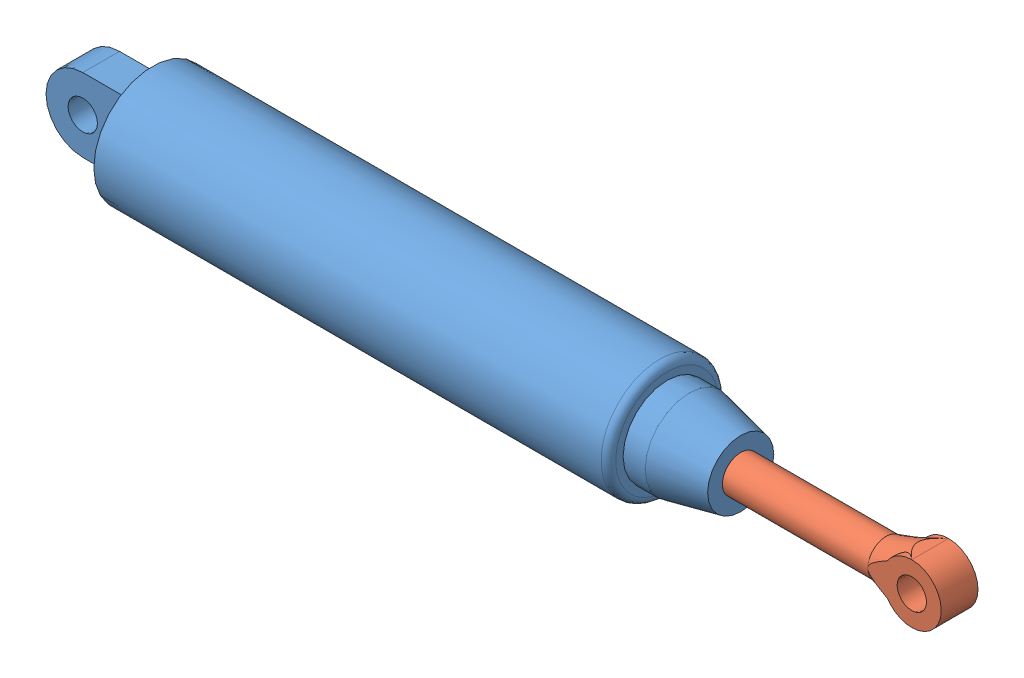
SolidWorks assembly verin.SLDASM, configuration Défaut (file format 4700). Lengths in mm.
Overall size (1217.76 160 160).
2 component instances, 2 part files, 2 mates.
Components (placement in the parent):
- corps verin-1: corps verin.SLDPRT [Défaut] at (-633.4104 38.2094 -67.1383) size (920 160 160)
- tige piston-1: tige piston.SLDPRT [Défaut] at (364.3543 38.2094 -67.1383) x (-1 0 0) z (0 0 -1) size (400 126.85 154.06)
Mates (geometry in assembly coordinates):
- Coaxiale1: concentric aligned: cylinder of corps verin-1 through (-233.4104 38.2094 -67.1383) axis (1 0 0) radius 25; cylinder of tige piston-1 through (64.3543 38.2094 -67.1383) axis (1 0 0) radius 25
- Parallèle1: parallel aligned: plane of corps verin-1 through (-703.4104 38.2094 -42.1383) normal (0 0 1); plane of tige piston-1 through (424.3543 38.2094 -42.1383) normal (0 0 1)
